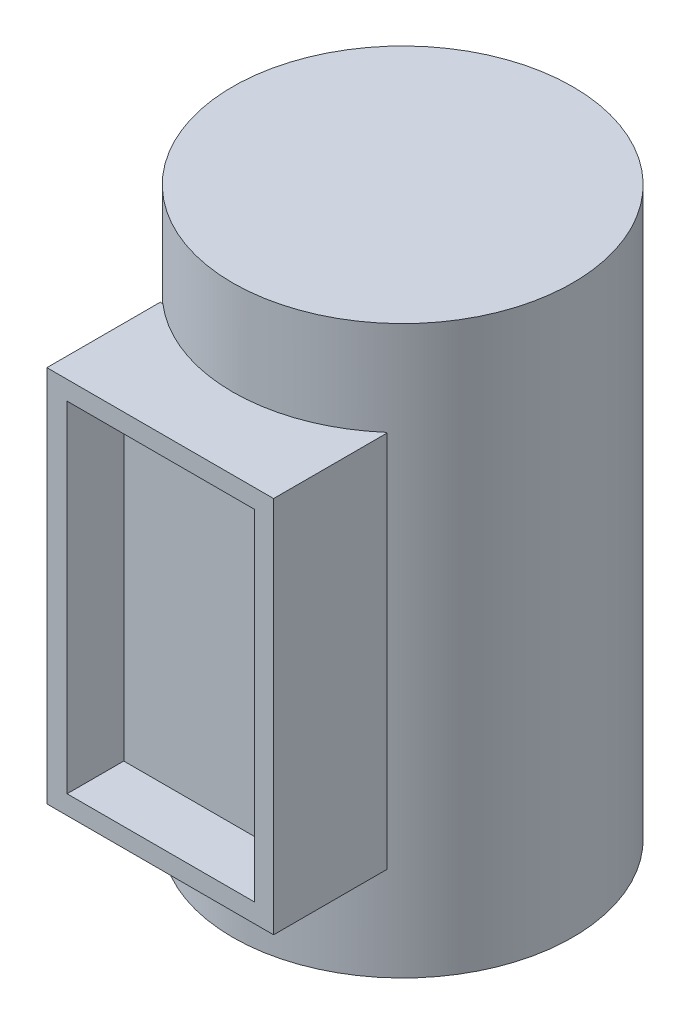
ISO-10303-21;
HEADER;
FILE_DESCRIPTION(('STEP AP214'),'2;1');
FILE_NAME('part.step','',(''),(''),'','','');
FILE_SCHEMA(('AUTOMOTIVE_DESIGN { 1 0 10303 214 1 1 1 1 }'));
ENDSEC;
DATA;
#1=APPLICATION_CONTEXT('core data for automotive mechanical design processes');
#2=APPLICATION_PROTOCOL_DEFINITION('international standard','automotive_design',2000,#1);
#3=PRODUCT_CONTEXT('',#1,'mechanical');
#4=PRODUCT('Part','Part','',(#3));
#5=PRODUCT_RELATED_PRODUCT_CATEGORY('part','',(#4));
#6=PRODUCT_DEFINITION_FORMATION('','',#4);
#7=PRODUCT_DEFINITION_CONTEXT('part definition',#1,'design');
#8=PRODUCT_DEFINITION('design','',#6,#7);
#9=PRODUCT_DEFINITION_SHAPE('','',#8);
#10=(LENGTH_UNIT() NAMED_UNIT(*) SI_UNIT(.MILLI.,.METRE.));
#11=(NAMED_UNIT(*) PLANE_ANGLE_UNIT() SI_UNIT($,.RADIAN.));
#12=(NAMED_UNIT(*) SI_UNIT($,.STERADIAN.) SOLID_ANGLE_UNIT());
#13=UNCERTAINTY_MEASURE_WITH_UNIT(LENGTH_MEASURE(1.E-05),#10,'distance_accuracy_value','');
#14=(GEOMETRIC_REPRESENTATION_CONTEXT(3) GLOBAL_UNCERTAINTY_ASSIGNED_CONTEXT((#13)) GLOBAL_UNIT_ASSIGNED_CONTEXT((#10,
#11,#12)) REPRESENTATION_CONTEXT('',''));
#15=CARTESIAN_POINT('',(0.,0.,0.));
#16=DIRECTION('',(0.,0.,1.));
#17=DIRECTION('',(1.,0.,0.));
#18=AXIS2_PLACEMENT_3D('',#15,#16,#17);
#19=CARTESIAN_POINT('',(0.,-75.,0.));
#20=DIRECTION('',(0.,1.,0.));
#21=DIRECTION('',(0.,0.,1.));
#22=AXIS2_PLACEMENT_3D('',#19,#20,#21);
#23=CYLINDRICAL_SURFACE('',#22,45.);
#24=CARTESIAN_POINT('',(0.,-50.,0.));
#25=DIRECTION('',(0.,-1.,0.));
#26=DIRECTION('',(0.,0.,-1.));
#27=AXIS2_PLACEMENT_3D('',#24,#25,#26);
#28=CIRCLE('',#27,45.);
#29=CARTESIAN_POINT('',(-29.4788059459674,-50.,34.));
#30=VERTEX_POINT('',#29);
#31=CARTESIAN_POINT('',(29.4788059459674,-50.,34.));
#32=VERTEX_POINT('',#31);
#33=EDGE_CURVE('E11',#30,#32,#28,.F.);
#34=ORIENTED_EDGE('',*,*,#33,.F.);
#35=DIRECTION('',(0.,1.,0.));
#36=VECTOR('',#35,1.);
#37=CARTESIAN_POINT('',(-29.4788059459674,-75.,34.));
#38=LINE('',#37,#36);
#39=CARTESIAN_POINT('',(-29.4788059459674,50.,34.));
#40=VERTEX_POINT('',#39);
#41=EDGE_CURVE('E47',#40,#30,#38,.F.);
#42=ORIENTED_EDGE('',*,*,#41,.F.);
#43=CARTESIAN_POINT('',(0.,50.,0.));
#44=DIRECTION('',(0.,-1.,0.));
#45=DIRECTION('',(0.,0.,-1.));
#46=AXIS2_PLACEMENT_3D('',#43,#44,#45);
#47=CIRCLE('',#46,45.);
#48=CARTESIAN_POINT('',(29.4788059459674,50.,34.));
#49=VERTEX_POINT('',#48);
#50=EDGE_CURVE('E222',#40,#49,#47,.F.);
#51=ORIENTED_EDGE('',*,*,#50,.T.);
#52=DIRECTION('',(0.,1.,0.));
#53=VECTOR('',#52,1.);
#54=CARTESIAN_POINT('',(29.4788059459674,-75.,34.));
#55=LINE('',#54,#53);
#56=EDGE_CURVE('E226',#32,#49,#55,.T.);
#57=ORIENTED_EDGE('',*,*,#56,.F.);
#58=EDGE_LOOP('',(#34,#42,#51,#57));
#59=FACE_BOUND('',#58,.T.);
#60=CARTESIAN_POINT('',(0.,-75.,0.));
#61=DIRECTION('',(0.,1.,0.));
#62=DIRECTION('',(0.,0.,1.));
#63=AXIS2_PLACEMENT_3D('',#60,#61,#62);
#64=CIRCLE('',#63,45.);
#65=CARTESIAN_POINT('',(0.,-75.,45.));
#66=VERTEX_POINT('',#65);
#67=EDGE_CURVE('E218',#66,#66,#64,.T.);
#68=ORIENTED_EDGE('',*,*,#67,.T.);
#69=EDGE_LOOP('',(#68));
#70=FACE_BOUND('',#69,.T.);
#71=CARTESIAN_POINT('',(0.,75.,0.));
#72=DIRECTION('',(0.,1.,0.));
#73=DIRECTION('',(0.,0.,1.));
#74=AXIS2_PLACEMENT_3D('',#71,#72,#73);
#75=CIRCLE('',#74,45.);
#76=CARTESIAN_POINT('',(0.,75.,45.));
#77=VERTEX_POINT('',#76);
#78=EDGE_CURVE('E205',#77,#77,#75,.T.);
#79=ORIENTED_EDGE('',*,*,#78,.F.);
#80=EDGE_LOOP('',(#79));
#81=FACE_BOUND('',#80,.T.);
#82=ADVANCED_FACE('F39',(#59,#70,#81),#23,.T.);
#83=CARTESIAN_POINT('',(0.,-75.,0.));
#84=DIRECTION('',(0.,1.,0.));
#85=DIRECTION('',(0.,0.,1.));
#86=AXIS2_PLACEMENT_3D('',#83,#84,#85);
#87=PLANE('',#86);
#88=CARTESIAN_POINT('',(0.,-75.,0.));
#89=DIRECTION('',(0.,-1.,0.));
#90=DIRECTION('',(0.,0.,-1.));
#91=AXIS2_PLACEMENT_3D('',#88,#89,#90);
#92=CIRCLE('',#91,40.);
#93=CARTESIAN_POINT('',(0.,-75.,-40.));
#94=VERTEX_POINT('',#93);
#95=EDGE_CURVE('E146',#94,#94,#92,.T.);
#96=ORIENTED_EDGE('',*,*,#95,.F.);
#97=EDGE_LOOP('',(#96));
#98=FACE_BOUND('',#97,.T.);
#99=ORIENTED_EDGE('',*,*,#67,.F.);
#100=EDGE_LOOP('',(#99));
#101=FACE_BOUND('',#100,.T.);
#102=ADVANCED_FACE('F268',(#98,#101),#87,.F.);
#103=CARTESIAN_POINT('',(0.,75.,0.));
#104=DIRECTION('',(0.,1.,0.));
#105=DIRECTION('',(0.,0.,1.));
#106=AXIS2_PLACEMENT_3D('',#103,#104,#105);
#107=PLANE('',#106);
#108=ORIENTED_EDGE('',*,*,#78,.T.);
#109=EDGE_LOOP('',(#108));
#110=FACE_BOUND('',#109,.T.);
#111=ADVANCED_FACE('F272',(#110),#107,.T.);
#112=CARTESIAN_POINT('',(-30.1735267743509,-50.,34.));
#113=DIRECTION('',(0.,0.,-1.));
#114=DIRECTION('',(-1.,0.,0.));
#115=AXIS2_PLACEMENT_3D('',#112,#113,#114);
#116=PLANE('',#115);
#117=DIRECTION('',(-1.,0.,0.));
#118=VECTOR('',#117,1.);
#119=CARTESIAN_POINT('',(-30.1735267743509,50.,34.));
#120=LINE('',#119,#118);
#121=CARTESIAN_POINT('',(-30.1735267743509,50.,34.));
#122=VERTEX_POINT('',#121);
#123=EDGE_CURVE('E173',#40,#122,#120,.T.);
#124=ORIENTED_EDGE('',*,*,#123,.F.);
#125=ORIENTED_EDGE('',*,*,#41,.T.);
#126=DIRECTION('',(-1.,0.,0.));
#127=VECTOR('',#126,1.);
#128=CARTESIAN_POINT('',(-30.1735267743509,-50.,34.));
#129=LINE('',#128,#127);
#130=CARTESIAN_POINT('',(-30.1735267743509,-50.,34.));
#131=VERTEX_POINT('',#130);
#132=EDGE_CURVE('E188',#30,#131,#129,.T.);
#133=ORIENTED_EDGE('',*,*,#132,.T.);
#134=DIRECTION('',(0.,1.,0.));
#135=VECTOR('',#134,1.);
#136=CARTESIAN_POINT('',(-30.1735267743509,-50.,34.));
#137=LINE('',#136,#135);
#138=EDGE_CURVE('E209',#131,#122,#137,.T.);
#139=ORIENTED_EDGE('',*,*,#138,.T.);
#140=EDGE_LOOP('',(#124,#125,#133,#139));
#141=FACE_BOUND('',#140,.T.);
#142=ADVANCED_FACE('F233',(#141),#116,.T.);
#143=CARTESIAN_POINT('',(29.8264732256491,-50.,64.));
#144=DIRECTION('',(1.,0.,0.));
#145=DIRECTION('',(0.,0.,-1.));
#146=AXIS2_PLACEMENT_3D('',#143,#144,#145);
#147=PLANE('',#146);
#148=DIRECTION('',(0.,1.,0.));
#149=VECTOR('',#148,1.);
#150=CARTESIAN_POINT('',(29.8264732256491,-50.,34.));
#151=LINE('',#150,#149);
#152=CARTESIAN_POINT('',(29.8264732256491,-50.,34.));
#153=VERTEX_POINT('',#152);
#154=CARTESIAN_POINT('',(29.8264732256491,50.,34.));
#155=VERTEX_POINT('',#154);
#156=EDGE_CURVE('E201',#153,#155,#151,.T.);
#157=ORIENTED_EDGE('',*,*,#156,.T.);
#158=DIRECTION('',(0.,0.,-1.));
#159=VECTOR('',#158,1.);
#160=CARTESIAN_POINT('',(29.8264732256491,50.,64.));
#161=LINE('',#160,#159);
#162=CARTESIAN_POINT('',(29.8264732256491,50.,64.));
#163=VERTEX_POINT('',#162);
#164=EDGE_CURVE('E165',#163,#155,#161,.T.);
#165=ORIENTED_EDGE('',*,*,#164,.F.);
#166=DIRECTION('',(0.,1.,0.));
#167=VECTOR('',#166,1.);
#168=CARTESIAN_POINT('',(29.8264732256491,-50.,64.));
#169=LINE('',#168,#167);
#170=CARTESIAN_POINT('',(29.8264732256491,-50.,64.));
#171=VERTEX_POINT('',#170);
#172=EDGE_CURVE('E202',#171,#163,#169,.T.);
#173=ORIENTED_EDGE('',*,*,#172,.F.);
#174=DIRECTION('',(0.,0.,-1.));
#175=VECTOR('',#174,1.);
#176=CARTESIAN_POINT('',(29.8264732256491,-50.,64.));
#177=LINE('',#176,#175);
#178=EDGE_CURVE('E184',#171,#153,#177,.T.);
#179=ORIENTED_EDGE('',*,*,#178,.T.);
#180=EDGE_LOOP('',(#157,#165,#173,#179));
#181=FACE_BOUND('',#180,.T.);
#182=ADVANCED_FACE('F249',(#181),#147,.T.);
#183=CARTESIAN_POINT('',(-30.1735267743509,-50.,64.));
#184=DIRECTION('',(0.,0.,1.));
#185=DIRECTION('',(1.,0.,0.));
#186=AXIS2_PLACEMENT_3D('',#183,#184,#185);
#187=PLANE('',#186);
#188=DIRECTION('',(1.,0.,0.));
#189=VECTOR('',#188,1.);
#190=CARTESIAN_POINT('',(-24.8264732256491,-45.,64.));
#191=LINE('',#190,#189);
#192=CARTESIAN_POINT('',(-24.8264732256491,-45.,64.));
#193=VERTEX_POINT('',#192);
#194=CARTESIAN_POINT('',(24.8264732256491,-45.,64.));
#195=VERTEX_POINT('',#194);
#196=EDGE_CURVE('E54',#193,#195,#191,.T.);
#197=ORIENTED_EDGE('',*,*,#196,.F.);
#198=DIRECTION('',(0.,-1.,0.));
#199=VECTOR('',#198,1.);
#200=CARTESIAN_POINT('',(-24.8264732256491,45.,64.));
#201=LINE('',#200,#199);
#202=CARTESIAN_POINT('',(-24.8264732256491,45.,64.));
#203=VERTEX_POINT('',#202);
#204=EDGE_CURVE('E139',#203,#193,#201,.T.);
#205=ORIENTED_EDGE('',*,*,#204,.F.);
#206=DIRECTION('',(1.,0.,0.));
#207=VECTOR('',#206,1.);
#208=CARTESIAN_POINT('',(-24.8264732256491,45.,64.));
#209=LINE('',#208,#207);
#210=CARTESIAN_POINT('',(24.8264732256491,45.,64.));
#211=VERTEX_POINT('',#210);
#212=EDGE_CURVE('E143',#203,#211,#209,.T.);
#213=ORIENTED_EDGE('',*,*,#212,.T.);
#214=DIRECTION('',(0.,-1.,0.));
#215=VECTOR('',#214,1.);
#216=CARTESIAN_POINT('',(24.8264732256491,45.,64.));
#217=LINE('',#216,#215);
#218=EDGE_CURVE('E155',#211,#195,#217,.T.);
#219=ORIENTED_EDGE('',*,*,#218,.T.);
#220=EDGE_LOOP('',(#197,#205,#213,#219));
#221=FACE_BOUND('',#220,.T.);
#222=ORIENTED_EDGE('',*,*,#172,.T.);
#223=DIRECTION('',(1.,0.,0.));
#224=VECTOR('',#223,1.);
#225=CARTESIAN_POINT('',(-30.1735267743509,50.,64.));
#226=LINE('',#225,#224);
#227=CARTESIAN_POINT('',(-30.1735267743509,50.,64.));
#228=VERTEX_POINT('',#227);
#229=EDGE_CURVE('E180',#228,#163,#226,.T.);
#230=ORIENTED_EDGE('',*,*,#229,.F.);
#231=DIRECTION('',(0.,1.,0.));
#232=VECTOR('',#231,1.);
#233=CARTESIAN_POINT('',(-30.1735267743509,-50.,64.));
#234=LINE('',#233,#232);
#235=CARTESIAN_POINT('',(-30.1735267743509,-50.,64.));
#236=VERTEX_POINT('',#235);
#237=EDGE_CURVE('E206',#236,#228,#234,.T.);
#238=ORIENTED_EDGE('',*,*,#237,.F.);
#239=DIRECTION('',(1.,0.,0.));
#240=VECTOR('',#239,1.);
#241=CARTESIAN_POINT('',(-30.1735267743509,-50.,64.));
#242=LINE('',#241,#240);
#243=EDGE_CURVE('E197',#236,#171,#242,.T.);
#244=ORIENTED_EDGE('',*,*,#243,.T.);
#245=EDGE_LOOP('',(#222,#230,#238,#244));
#246=FACE_BOUND('',#245,.T.);
#247=ADVANCED_FACE('F253',(#221,#246),#187,.T.);
#248=CARTESIAN_POINT('',(-30.1735267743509,-50.,64.));
#249=DIRECTION('',(-1.,0.,0.));
#250=DIRECTION('',(0.,0.,1.));
#251=AXIS2_PLACEMENT_3D('',#248,#249,#250);
#252=PLANE('',#251);
#253=ORIENTED_EDGE('',*,*,#237,.T.);
#254=DIRECTION('',(0.,0.,1.));
#255=VECTOR('',#254,1.);
#256=CARTESIAN_POINT('',(-30.1735267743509,50.,64.));
#257=LINE('',#256,#255);
#258=EDGE_CURVE('E176',#122,#228,#257,.T.);
#259=ORIENTED_EDGE('',*,*,#258,.F.);
#260=ORIENTED_EDGE('',*,*,#138,.F.);
#261=DIRECTION('',(0.,0.,1.));
#262=VECTOR('',#261,1.);
#263=CARTESIAN_POINT('',(-30.1735267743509,-50.,64.));
#264=LINE('',#263,#262);
#265=EDGE_CURVE('E193',#131,#236,#264,.T.);
#266=ORIENTED_EDGE('',*,*,#265,.T.);
#267=EDGE_LOOP('',(#253,#259,#260,#266));
#268=FACE_BOUND('',#267,.T.);
#269=ADVANCED_FACE('F257',(#268),#252,.T.);
#270=EDGE_CURVE('E189',#153,#32,#129,.T.);
#271=ORIENTED_EDGE('',*,*,#270,.T.);
#272=ORIENTED_EDGE('',*,*,#56,.T.);
#273=EDGE_CURVE('E62',#155,#49,#120,.T.);
#274=ORIENTED_EDGE('',*,*,#273,.F.);
#275=ORIENTED_EDGE('',*,*,#156,.F.);
#276=EDGE_LOOP('',(#271,#272,#274,#275));
#277=FACE_BOUND('',#276,.T.);
#278=ADVANCED_FACE('F246',(#277),#116,.T.);
#279=CARTESIAN_POINT('',(0.,-50.,0.));
#280=DIRECTION('',(0.,-1.,0.));
#281=DIRECTION('',(0.,0.,-1.));
#282=AXIS2_PLACEMENT_3D('',#279,#280,#281);
#283=PLANE('',#282);
#284=ORIENTED_EDGE('',*,*,#132,.F.);
#285=ORIENTED_EDGE('',*,*,#33,.T.);
#286=ORIENTED_EDGE('',*,*,#270,.F.);
#287=ORIENTED_EDGE('',*,*,#178,.F.);
#288=ORIENTED_EDGE('',*,*,#243,.F.);
#289=ORIENTED_EDGE('',*,*,#265,.F.);
#290=EDGE_LOOP('',(#284,#285,#286,#287,#288,#289));
#291=FACE_BOUND('',#290,.T.);
#292=ADVANCED_FACE('F239',(#291),#283,.T.);
#293=CARTESIAN_POINT('',(0.,50.,0.));
#294=DIRECTION('',(0.,-1.,0.));
#295=DIRECTION('',(0.,0.,-1.));
#296=AXIS2_PLACEMENT_3D('',#293,#294,#295);
#297=PLANE('',#296);
#298=ORIENTED_EDGE('',*,*,#50,.F.);
#299=ORIENTED_EDGE('',*,*,#123,.T.);
#300=ORIENTED_EDGE('',*,*,#258,.T.);
#301=ORIENTED_EDGE('',*,*,#229,.T.);
#302=ORIENTED_EDGE('',*,*,#164,.T.);
#303=ORIENTED_EDGE('',*,*,#273,.T.);
#304=EDGE_LOOP('',(#298,#299,#300,#301,#302,#303));
#305=FACE_BOUND('',#304,.T.);
#306=ADVANCED_FACE('F254',(#305),#297,.F.);
#307=CARTESIAN_POINT('',(-24.8264732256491,-45.,49.));
#308=DIRECTION('',(0.,-1.,0.));
#309=DIRECTION('',(0.,0.,-1.));
#310=AXIS2_PLACEMENT_3D('',#307,#308,#309);
#311=PLANE('',#310);
#312=ORIENTED_EDGE('',*,*,#196,.T.);
#313=DIRECTION('',(0.,0.,1.));
#314=VECTOR('',#313,1.);
#315=CARTESIAN_POINT('',(24.8264732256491,-45.,49.));
#316=LINE('',#315,#314);
#317=CARTESIAN_POINT('',(24.8264732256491,-45.,49.));
#318=VERTEX_POINT('',#317);
#319=EDGE_CURVE('E120',#318,#195,#316,.T.);
#320=ORIENTED_EDGE('',*,*,#319,.F.);
#321=DIRECTION('',(1.,0.,0.));
#322=VECTOR('',#321,1.);
#323=CARTESIAN_POINT('',(-24.8264732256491,-45.,49.));
#324=LINE('',#323,#322);
#325=CARTESIAN_POINT('',(-24.8264732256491,-45.,49.));
#326=VERTEX_POINT('',#325);
#327=EDGE_CURVE('E128',#326,#318,#324,.T.);
#328=ORIENTED_EDGE('',*,*,#327,.F.);
#329=DIRECTION('',(0.,0.,1.));
#330=VECTOR('',#329,1.);
#331=CARTESIAN_POINT('',(-24.8264732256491,-45.,49.));
#332=LINE('',#331,#330);
#333=EDGE_CURVE('E162',#326,#193,#332,.T.);
#334=ORIENTED_EDGE('',*,*,#333,.T.);
#335=EDGE_LOOP('',(#312,#320,#328,#334));
#336=FACE_BOUND('',#335,.T.);
#337=ADVANCED_FACE('F131',(#336),#311,.F.);
#338=CARTESIAN_POINT('',(-24.8264732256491,45.,49.));
#339=DIRECTION('',(-1.,0.,0.));
#340=DIRECTION('',(0.,0.,1.));
#341=AXIS2_PLACEMENT_3D('',#338,#339,#340);
#342=PLANE('',#341);
#343=ORIENTED_EDGE('',*,*,#204,.T.);
#344=ORIENTED_EDGE('',*,*,#333,.F.);
#345=DIRECTION('',(0.,-1.,0.));
#346=VECTOR('',#345,1.);
#347=CARTESIAN_POINT('',(-24.8264732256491,45.,49.));
#348=LINE('',#347,#346);
#349=CARTESIAN_POINT('',(-24.8264732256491,45.,49.));
#350=VERTEX_POINT('',#349);
#351=EDGE_CURVE('E134',#350,#326,#348,.T.);
#352=ORIENTED_EDGE('',*,*,#351,.F.);
#353=DIRECTION('',(0.,0.,1.));
#354=VECTOR('',#353,1.);
#355=CARTESIAN_POINT('',(-24.8264732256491,45.,49.));
#356=LINE('',#355,#354);
#357=EDGE_CURVE('E166',#350,#203,#356,.T.);
#358=ORIENTED_EDGE('',*,*,#357,.T.);
#359=EDGE_LOOP('',(#343,#344,#352,#358));
#360=FACE_BOUND('',#359,.T.);
#361=ADVANCED_FACE('F332',(#360),#342,.F.);
#362=CARTESIAN_POINT('',(-24.8264732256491,45.,49.));
#363=DIRECTION('',(0.,-1.,0.));
#364=DIRECTION('',(0.,0.,-1.));
#365=AXIS2_PLACEMENT_3D('',#362,#363,#364);
#366=PLANE('',#365);
#367=ORIENTED_EDGE('',*,*,#212,.F.);
#368=ORIENTED_EDGE('',*,*,#357,.F.);
#369=DIRECTION('',(1.,0.,0.));
#370=VECTOR('',#369,1.);
#371=CARTESIAN_POINT('',(-24.8264732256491,45.,49.));
#372=LINE('',#371,#370);
#373=CARTESIAN_POINT('',(24.8264732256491,45.,49.));
#374=VERTEX_POINT('',#373);
#375=EDGE_CURVE('E127',#350,#374,#372,.T.);
#376=ORIENTED_EDGE('',*,*,#375,.T.);
#377=DIRECTION('',(0.,0.,1.));
#378=VECTOR('',#377,1.);
#379=CARTESIAN_POINT('',(24.8264732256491,45.,49.));
#380=LINE('',#379,#378);
#381=EDGE_CURVE('E122',#374,#211,#380,.T.);
#382=ORIENTED_EDGE('',*,*,#381,.T.);
#383=EDGE_LOOP('',(#367,#368,#376,#382));
#384=FACE_BOUND('',#383,.T.);
#385=ADVANCED_FACE('F335',(#384),#366,.T.);
#386=CARTESIAN_POINT('',(24.8264732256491,45.,49.));
#387=DIRECTION('',(-1.,0.,0.));
#388=DIRECTION('',(0.,0.,1.));
#389=AXIS2_PLACEMENT_3D('',#386,#387,#388);
#390=PLANE('',#389);
#391=ORIENTED_EDGE('',*,*,#218,.F.);
#392=ORIENTED_EDGE('',*,*,#381,.F.);
#393=DIRECTION('',(0.,-1.,0.));
#394=VECTOR('',#393,1.);
#395=CARTESIAN_POINT('',(24.8264732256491,45.,49.));
#396=LINE('',#395,#394);
#397=EDGE_CURVE('E117',#374,#318,#396,.T.);
#398=ORIENTED_EDGE('',*,*,#397,.T.);
#399=ORIENTED_EDGE('',*,*,#319,.T.);
#400=EDGE_LOOP('',(#391,#392,#398,#399));
#401=FACE_BOUND('',#400,.T.);
#402=ADVANCED_FACE('F119',(#401),#390,.T.);
#403=CARTESIAN_POINT('',(0.,0.,49.));
#404=DIRECTION('',(0.,0.,-1.));
#405=DIRECTION('',(-1.,0.,0.));
#406=AXIS2_PLACEMENT_3D('',#403,#404,#405);
#407=PLANE('',#406);
#408=ORIENTED_EDGE('',*,*,#327,.T.);
#409=ORIENTED_EDGE('',*,*,#397,.F.);
#410=ORIENTED_EDGE('',*,*,#375,.F.);
#411=ORIENTED_EDGE('',*,*,#351,.T.);
#412=EDGE_LOOP('',(#408,#409,#410,#411));
#413=FACE_BOUND('',#412,.T.);
#414=ADVANCED_FACE('F136',(#413),#407,.F.);
#415=CARTESIAN_POINT('',(0.,70.,0.));
#416=DIRECTION('',(0.,-1.,0.));
#417=DIRECTION('',(0.,0.,-1.));
#418=AXIS2_PLACEMENT_3D('',#415,#416,#417);
#419=CYLINDRICAL_SURFACE('',#418,40.);
#420=CARTESIAN_POINT('',(0.,70.,0.));
#421=DIRECTION('',(0.,-1.,0.));
#422=DIRECTION('',(0.,0.,-1.));
#423=AXIS2_PLACEMENT_3D('',#420,#421,#422);
#424=CIRCLE('',#423,40.);
#425=CARTESIAN_POINT('',(0.,70.,-40.));
#426=VERTEX_POINT('',#425);
#427=EDGE_CURVE('E156',#426,#426,#424,.T.);
#428=ORIENTED_EDGE('',*,*,#427,.F.);
#429=EDGE_LOOP('',(#428));
#430=FACE_BOUND('',#429,.T.);
#431=ORIENTED_EDGE('',*,*,#95,.T.);
#432=EDGE_LOOP('',(#431));
#433=FACE_BOUND('',#432,.T.);
#434=ADVANCED_FACE('F310',(#430,#433),#419,.F.);
#435=CARTESIAN_POINT('',(0.,70.,0.));
#436=DIRECTION('',(0.,-1.,0.));
#437=DIRECTION('',(0.,0.,-1.));
#438=AXIS2_PLACEMENT_3D('',#435,#436,#437);
#439=PLANE('',#438);
#440=ORIENTED_EDGE('',*,*,#427,.T.);
#441=EDGE_LOOP('',(#440));
#442=FACE_BOUND('',#441,.T.);
#443=ADVANCED_FACE('F315',(#442),#439,.T.);
#444=CLOSED_SHELL('',(#82,#102,#111,#142,#182,#247,#269,#278,#292,#306,#337,#361,#385,#402,#414,
#434,#443));
#445=MANIFOLD_SOLID_BREP('B2',#444);
#446=ADVANCED_BREP_SHAPE_REPRESENTATION('',(#18,#445),#14);
#447=SHAPE_DEFINITION_REPRESENTATION(#9,#446);
ENDSEC;
END-ISO-10303-21;
